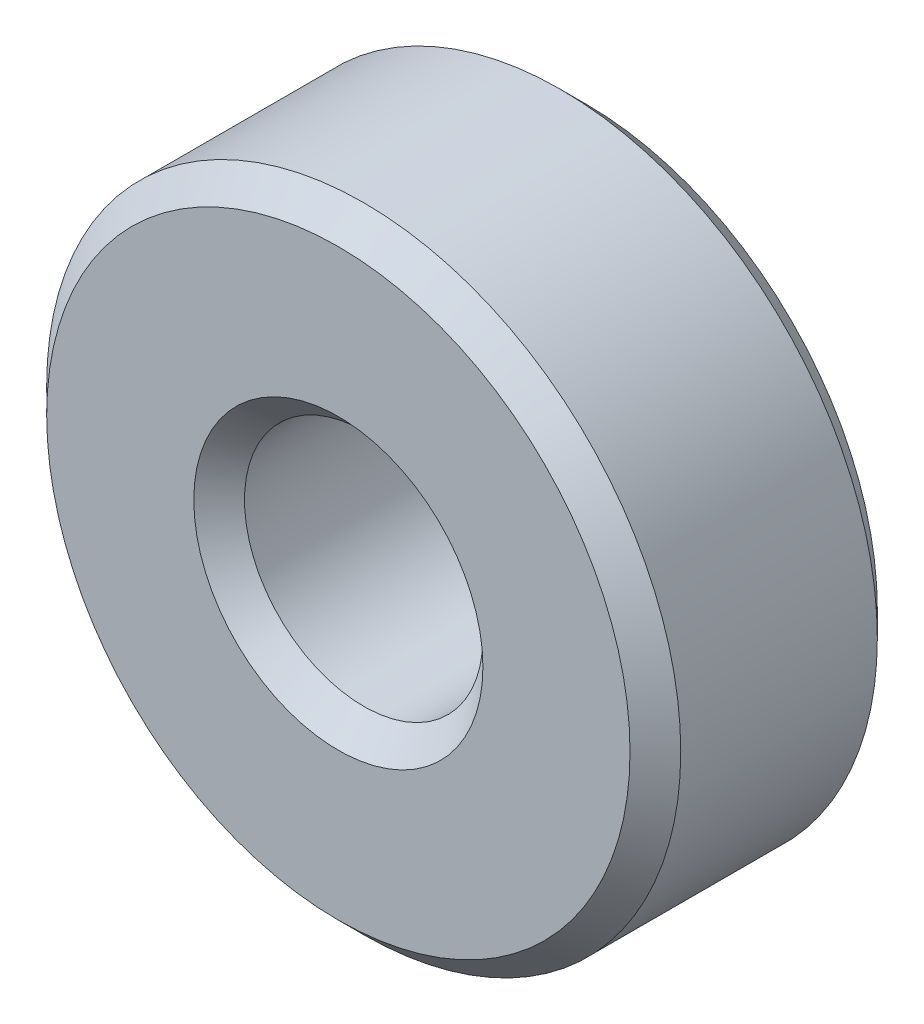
ISO-10303-21;
HEADER;
FILE_DESCRIPTION(('STEP AP214'),'2;1');
FILE_NAME('part.step','',(''),(''),'','','');
FILE_SCHEMA(('AUTOMOTIVE_DESIGN { 1 0 10303 214 1 1 1 1 }'));
ENDSEC;
DATA;
#1=APPLICATION_CONTEXT('core data for automotive mechanical design processes');
#2=APPLICATION_PROTOCOL_DEFINITION('international standard','automotive_design',2000,#1);
#3=PRODUCT_CONTEXT('',#1,'mechanical');
#4=PRODUCT('Part','Part','',(#3));
#5=PRODUCT_RELATED_PRODUCT_CATEGORY('part','',(#4));
#6=PRODUCT_DEFINITION_FORMATION('','',#4);
#7=PRODUCT_DEFINITION_CONTEXT('part definition',#1,'design');
#8=PRODUCT_DEFINITION('design','',#6,#7);
#9=PRODUCT_DEFINITION_SHAPE('','',#8);
#10=(LENGTH_UNIT() NAMED_UNIT(*) SI_UNIT(.MILLI.,.METRE.));
#11=(NAMED_UNIT(*) PLANE_ANGLE_UNIT() SI_UNIT($,.RADIAN.));
#12=(NAMED_UNIT(*) SI_UNIT($,.STERADIAN.) SOLID_ANGLE_UNIT());
#13=UNCERTAINTY_MEASURE_WITH_UNIT(LENGTH_MEASURE(1.E-05),#10,'distance_accuracy_value','');
#14=(GEOMETRIC_REPRESENTATION_CONTEXT(3) GLOBAL_UNCERTAINTY_ASSIGNED_CONTEXT((#13)) GLOBAL_UNIT_ASSIGNED_CONTEXT((#10,
#11,#12)) REPRESENTATION_CONTEXT('',''));
#15=CARTESIAN_POINT('',(0.,0.,0.));
#16=DIRECTION('',(0.,0.,1.));
#17=DIRECTION('',(1.,0.,0.));
#18=AXIS2_PLACEMENT_3D('',#15,#16,#17);
#19=CARTESIAN_POINT('',(0.,0.,4.953));
#20=DIRECTION('',(0.,0.,1.));
#21=DIRECTION('',(1.,0.,0.));
#22=AXIS2_PLACEMENT_3D('',#19,#20,#21);
#23=PLANE('',#22);
#24=CARTESIAN_POINT('',(0.,0.,4.953));
#25=DIRECTION('',(0.,0.,1.));
#26=DIRECTION('',(1.,0.,0.));
#27=AXIS2_PLACEMENT_3D('',#24,#25,#26);
#28=CIRCLE('',#27,5.842);
#29=CARTESIAN_POINT('',(5.842,0.,4.953));
#30=VERTEX_POINT('',#29);
#31=EDGE_CURVE('E41',#30,#30,#28,.T.);
#32=ORIENTED_EDGE('',*,*,#31,.T.);
#33=EDGE_LOOP('',(#32));
#34=FACE_BOUND('',#33,.T.);
#35=CARTESIAN_POINT('',(0.,0.,4.953));
#36=DIRECTION('',(0.,0.,1.));
#37=DIRECTION('',(1.,0.,0.));
#38=AXIS2_PLACEMENT_3D('',#35,#36,#37);
#39=CIRCLE('',#38,2.8956);
#40=CARTESIAN_POINT('',(2.8956,0.,4.953));
#41=VERTEX_POINT('',#40);
#42=EDGE_CURVE('E45',#41,#41,#39,.F.);
#43=ORIENTED_EDGE('',*,*,#42,.T.);
#44=EDGE_LOOP('',(#43));
#45=FACE_BOUND('',#44,.T.);
#46=ADVANCED_FACE('F30',(#34,#45),#23,.T.);
#47=CARTESIAN_POINT('',(0.,0.,0.));
#48=DIRECTION('',(0.,0.,1.));
#49=DIRECTION('',(1.,0.,0.));
#50=AXIS2_PLACEMENT_3D('',#47,#48,#49);
#51=PLANE('',#50);
#52=CARTESIAN_POINT('',(0.,0.,0.));
#53=DIRECTION('',(0.,0.,1.));
#54=DIRECTION('',(1.,0.,0.));
#55=AXIS2_PLACEMENT_3D('',#52,#53,#54);
#56=CIRCLE('',#55,5.842);
#57=CARTESIAN_POINT('',(5.842,0.,0.));
#58=VERTEX_POINT('',#57);
#59=EDGE_CURVE('E50',#58,#58,#56,.F.);
#60=ORIENTED_EDGE('',*,*,#59,.T.);
#61=EDGE_LOOP('',(#60));
#62=FACE_BOUND('',#61,.T.);
#63=CARTESIAN_POINT('',(0.,0.,0.));
#64=DIRECTION('',(0.,0.,1.));
#65=DIRECTION('',(1.,0.,0.));
#66=AXIS2_PLACEMENT_3D('',#63,#64,#65);
#67=CIRCLE('',#66,2.8956);
#68=CARTESIAN_POINT('',(2.8956,0.,0.));
#69=VERTEX_POINT('',#68);
#70=EDGE_CURVE('E53',#69,#69,#67,.T.);
#71=ORIENTED_EDGE('',*,*,#70,.T.);
#72=EDGE_LOOP('',(#71));
#73=FACE_BOUND('',#72,.T.);
#74=ADVANCED_FACE('F75',(#62,#73),#51,.F.);
#75=CARTESIAN_POINT('',(0.,0.,4.953));
#76=DIRECTION('',(0.,0.,-1.));
#77=DIRECTION('',(-1.,0.,0.));
#78=AXIS2_PLACEMENT_3D('',#75,#76,#77);
#79=CYLINDRICAL_SURFACE('',#78,6.35);
#80=CARTESIAN_POINT('',(0.,0.,0.507999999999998));
#81=DIRECTION('',(0.,0.,1.));
#82=DIRECTION('',(1.,0.,0.));
#83=AXIS2_PLACEMENT_3D('',#80,#81,#82);
#84=CIRCLE('',#83,6.35);
#85=CARTESIAN_POINT('',(6.35,0.,0.507999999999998));
#86=VERTEX_POINT('',#85);
#87=EDGE_CURVE('E56',#86,#86,#84,.T.);
#88=ORIENTED_EDGE('',*,*,#87,.T.);
#89=EDGE_LOOP('',(#88));
#90=FACE_BOUND('',#89,.T.);
#91=CARTESIAN_POINT('',(0.,0.,4.44500000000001));
#92=DIRECTION('',(0.,0.,1.));
#93=DIRECTION('',(1.,0.,0.));
#94=AXIS2_PLACEMENT_3D('',#91,#92,#93);
#95=CIRCLE('',#94,6.35);
#96=CARTESIAN_POINT('',(6.35,0.,4.44500000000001));
#97=VERTEX_POINT('',#96);
#98=EDGE_CURVE('E59',#97,#97,#95,.F.);
#99=ORIENTED_EDGE('',*,*,#98,.T.);
#100=EDGE_LOOP('',(#99));
#101=FACE_BOUND('',#100,.T.);
#102=ADVANCED_FACE('F63',(#90,#101),#79,.T.);
#103=CARTESIAN_POINT('',(0.,0.,4.953));
#104=DIRECTION('',(0.,0.,-1.));
#105=DIRECTION('',(-1.,0.,0.));
#106=AXIS2_PLACEMENT_3D('',#103,#104,#105);
#107=CYLINDRICAL_SURFACE('',#106,2.3876);
#108=CARTESIAN_POINT('',(0.,0.,0.508000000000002));
#109=DIRECTION('',(0.,0.,1.));
#110=DIRECTION('',(1.,0.,0.));
#111=AXIS2_PLACEMENT_3D('',#108,#109,#110);
#112=CIRCLE('',#111,2.3876);
#113=CARTESIAN_POINT('',(2.3876,0.,0.508000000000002));
#114=VERTEX_POINT('',#113);
#115=EDGE_CURVE('E10',#114,#114,#112,.F.);
#116=ORIENTED_EDGE('',*,*,#115,.T.);
#117=EDGE_LOOP('',(#116));
#118=FACE_BOUND('',#117,.T.);
#119=CARTESIAN_POINT('',(0.,0.,4.445));
#120=DIRECTION('',(0.,0.,1.));
#121=DIRECTION('',(1.,0.,0.));
#122=AXIS2_PLACEMENT_3D('',#119,#120,#121);
#123=CIRCLE('',#122,2.3876);
#124=CARTESIAN_POINT('',(2.3876,0.,4.445));
#125=VERTEX_POINT('',#124);
#126=EDGE_CURVE('E37',#125,#125,#123,.T.);
#127=ORIENTED_EDGE('',*,*,#126,.T.);
#128=EDGE_LOOP('',(#127));
#129=FACE_BOUND('',#128,.T.);
#130=ADVANCED_FACE('F91',(#118,#129),#107,.F.);
#131=CARTESIAN_POINT('',(0.,0.,0.507999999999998));
#132=DIRECTION('',(0.,0.,1.));
#133=DIRECTION('',(1.,0.,0.));
#134=AXIS2_PLACEMENT_3D('',#131,#132,#133);
#135=CONICAL_SURFACE('',#134,6.35,0.78539816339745);
#136=ORIENTED_EDGE('',*,*,#59,.F.);
#137=EDGE_LOOP('',(#136));
#138=FACE_BOUND('',#137,.T.);
#139=ORIENTED_EDGE('',*,*,#87,.F.);
#140=EDGE_LOOP('',(#139));
#141=FACE_BOUND('',#140,.T.);
#142=ADVANCED_FACE('F69',(#138,#141),#135,.T.);
#143=CARTESIAN_POINT('',(0.,0.,4.953));
#144=DIRECTION('',(0.,0.,-1.));
#145=DIRECTION('',(-1.,0.,0.));
#146=AXIS2_PLACEMENT_3D('',#143,#144,#145);
#147=CONICAL_SURFACE('',#146,5.842,0.785398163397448);
#148=ORIENTED_EDGE('',*,*,#98,.F.);
#149=EDGE_LOOP('',(#148));
#150=FACE_BOUND('',#149,.T.);
#151=ORIENTED_EDGE('',*,*,#31,.F.);
#152=EDGE_LOOP('',(#151));
#153=FACE_BOUND('',#152,.T.);
#154=ADVANCED_FACE('F65',(#150,#153),#147,.T.);
#155=CARTESIAN_POINT('',(0.,0.,0.));
#156=DIRECTION('',(0.,0.,-1.));
#157=DIRECTION('',(-1.,0.,0.));
#158=AXIS2_PLACEMENT_3D('',#155,#156,#157);
#159=CONICAL_SURFACE('',#158,2.8956,0.785398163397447);
#160=ORIENTED_EDGE('',*,*,#115,.F.);
#161=EDGE_LOOP('',(#160));
#162=FACE_BOUND('',#161,.T.);
#163=ORIENTED_EDGE('',*,*,#70,.F.);
#164=EDGE_LOOP('',(#163));
#165=FACE_BOUND('',#164,.T.);
#166=ADVANCED_FACE('F68',(#162,#165),#159,.F.);
#167=CARTESIAN_POINT('',(0.,0.,4.445));
#168=DIRECTION('',(0.,0.,1.));
#169=DIRECTION('',(1.,0.,0.));
#170=AXIS2_PLACEMENT_3D('',#167,#168,#169);
#171=CONICAL_SURFACE('',#170,2.3876,0.785398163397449);
#172=ORIENTED_EDGE('',*,*,#42,.F.);
#173=EDGE_LOOP('',(#172));
#174=FACE_BOUND('',#173,.T.);
#175=ORIENTED_EDGE('',*,*,#126,.F.);
#176=EDGE_LOOP('',(#175));
#177=FACE_BOUND('',#176,.T.);
#178=ADVANCED_FACE('F32',(#174,#177),#171,.F.);
#179=CLOSED_SHELL('',(#46,#74,#102,#130,#142,#154,#166,#178));
#180=MANIFOLD_SOLID_BREP('B2',#179);
#181=ADVANCED_BREP_SHAPE_REPRESENTATION('',(#18,#180),#14);
#182=SHAPE_DEFINITION_REPRESENTATION(#9,#181);
ENDSEC;
END-ISO-10303-21;
